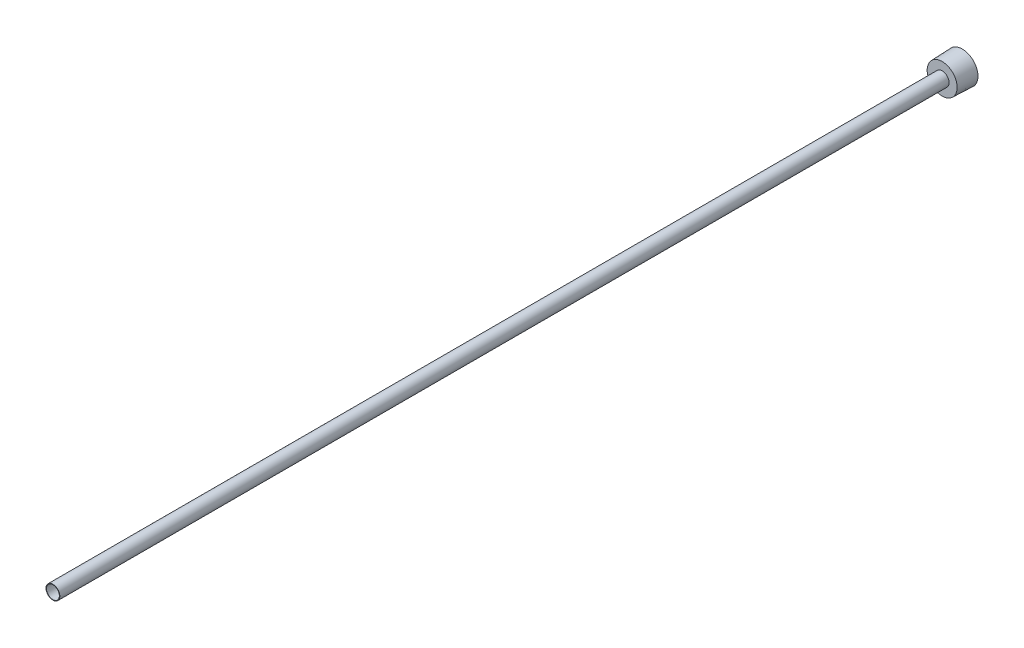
ISO-10303-21;
HEADER;
FILE_DESCRIPTION(('STEP AP214'),'2;1');
FILE_NAME('part.step','',(''),(''),'','','');
FILE_SCHEMA(('AUTOMOTIVE_DESIGN { 1 0 10303 214 1 1 1 1 }'));
ENDSEC;
DATA;
#1=APPLICATION_CONTEXT('core data for automotive mechanical design processes');
#2=APPLICATION_PROTOCOL_DEFINITION('international standard','automotive_design',2000,#1);
#3=PRODUCT_CONTEXT('',#1,'mechanical');
#4=PRODUCT('Part','Part','',(#3));
#5=PRODUCT_RELATED_PRODUCT_CATEGORY('part','',(#4));
#6=PRODUCT_DEFINITION_FORMATION('','',#4);
#7=PRODUCT_DEFINITION_CONTEXT('part definition',#1,'design');
#8=PRODUCT_DEFINITION('design','',#6,#7);
#9=PRODUCT_DEFINITION_SHAPE('','',#8);
#10=(LENGTH_UNIT() NAMED_UNIT(*) SI_UNIT(.MILLI.,.METRE.));
#11=(NAMED_UNIT(*) PLANE_ANGLE_UNIT() SI_UNIT($,.RADIAN.));
#12=(NAMED_UNIT(*) SI_UNIT($,.STERADIAN.) SOLID_ANGLE_UNIT());
#13=UNCERTAINTY_MEASURE_WITH_UNIT(LENGTH_MEASURE(1.E-05),#10,'distance_accuracy_value','');
#14=(GEOMETRIC_REPRESENTATION_CONTEXT(3) GLOBAL_UNCERTAINTY_ASSIGNED_CONTEXT((#13)) GLOBAL_UNIT_ASSIGNED_CONTEXT((#10,
#11,#12)) REPRESENTATION_CONTEXT('',''));
#15=CARTESIAN_POINT('',(0.,0.,0.));
#16=DIRECTION('',(0.,0.,1.));
#17=DIRECTION('',(1.,0.,0.));
#18=AXIS2_PLACEMENT_3D('',#15,#16,#17);
#19=CARTESIAN_POINT('',(0.,0.,0.));
#20=DIRECTION('',(0.,0.,1.));
#21=DIRECTION('',(1.,0.,0.));
#22=AXIS2_PLACEMENT_3D('',#19,#20,#21);
#23=CYLINDRICAL_SURFACE('',#22,4.318);
#24=CARTESIAN_POINT('',(0.,0.,609.6));
#25=DIRECTION('',(0.,0.,1.));
#26=DIRECTION('',(1.,0.,0.));
#27=AXIS2_PLACEMENT_3D('',#24,#25,#26);
#28=CIRCLE('',#27,4.318);
#29=CARTESIAN_POINT('',(4.318,0.,609.6));
#30=VERTEX_POINT('',#29);
#31=EDGE_CURVE('E142',#30,#30,#28,.T.);
#32=CARTESIAN_POINT('',(0.,0.,9.525));
#33=DIRECTION('',(0.,0.,-1.));
#34=DIRECTION('',(-1.,0.,0.));
#35=AXIS2_PLACEMENT_3D('',#32,#33,#34);
#36=CIRCLE('',#35,4.318);
#37=CARTESIAN_POINT('',(4.318,0.,9.525));
#38=VERTEX_POINT('',#37);
#39=EDGE_CURVE('E37',#38,#38,#36,.F.);
#40=CARTESIAN_POINT('',(4.318,0.,609.6));
#41=CARTESIAN_POINT('',(4.318,0.,603.34921875));
#42=CARTESIAN_POINT('',(4.318,0.,597.0984375));
#43=CARTESIAN_POINT('',(4.318,0.,584.596875));
#44=CARTESIAN_POINT('',(4.318,0.,578.34609375));
#45=CARTESIAN_POINT('',(4.318,0.,565.84453125));
#46=CARTESIAN_POINT('',(4.318,0.,559.59375));
#47=CARTESIAN_POINT('',(4.318,0.,547.0921875));
#48=CARTESIAN_POINT('',(4.318,0.,540.84140625));
#49=CARTESIAN_POINT('',(4.318,0.,528.33984375));
#50=CARTESIAN_POINT('',(4.318,0.,522.0890625));
#51=CARTESIAN_POINT('',(4.318,0.,509.5875));
#52=CARTESIAN_POINT('',(4.318,0.,503.33671875));
#53=CARTESIAN_POINT('',(4.318,0.,490.83515625));
#54=CARTESIAN_POINT('',(4.318,0.,484.584375));
#55=CARTESIAN_POINT('',(4.318,0.,472.0828125));
#56=CARTESIAN_POINT('',(4.318,0.,465.83203125));
#57=CARTESIAN_POINT('',(4.318,0.,453.33046875));
#58=CARTESIAN_POINT('',(4.318,0.,447.0796875));
#59=CARTESIAN_POINT('',(4.318,0.,434.578125));
#60=CARTESIAN_POINT('',(4.318,0.,428.32734375));
#61=CARTESIAN_POINT('',(4.318,0.,415.82578125));
#62=CARTESIAN_POINT('',(4.318,0.,409.575));
#63=CARTESIAN_POINT('',(4.318,0.,397.0734375));
#64=CARTESIAN_POINT('',(4.318,0.,390.82265625));
#65=CARTESIAN_POINT('',(4.318,0.,378.32109375));
#66=CARTESIAN_POINT('',(4.318,0.,372.0703125));
#67=CARTESIAN_POINT('',(4.318,0.,359.56875));
#68=CARTESIAN_POINT('',(4.318,0.,353.31796875));
#69=CARTESIAN_POINT('',(4.318,0.,340.81640625));
#70=CARTESIAN_POINT('',(4.318,0.,334.565625));
#71=CARTESIAN_POINT('',(4.318,0.,322.0640625));
#72=CARTESIAN_POINT('',(4.318,0.,315.81328125));
#73=CARTESIAN_POINT('',(4.318,0.,303.31171875));
#74=CARTESIAN_POINT('',(4.318,0.,297.0609375));
#75=CARTESIAN_POINT('',(4.318,0.,284.559375));
#76=CARTESIAN_POINT('',(4.318,0.,278.30859375));
#77=CARTESIAN_POINT('',(4.318,0.,265.80703125));
#78=CARTESIAN_POINT('',(4.318,0.,259.55625));
#79=CARTESIAN_POINT('',(4.318,0.,247.0546875));
#80=CARTESIAN_POINT('',(4.318,0.,240.80390625));
#81=CARTESIAN_POINT('',(4.318,0.,228.30234375));
#82=CARTESIAN_POINT('',(4.318,0.,222.0515625));
#83=CARTESIAN_POINT('',(4.318,0.,209.55));
#84=CARTESIAN_POINT('',(4.318,0.,203.29921875));
#85=CARTESIAN_POINT('',(4.318,0.,190.79765625));
#86=CARTESIAN_POINT('',(4.318,0.,184.546875));
#87=CARTESIAN_POINT('',(4.318,0.,172.0453125));
#88=CARTESIAN_POINT('',(4.318,0.,165.79453125));
#89=CARTESIAN_POINT('',(4.318,0.,153.29296875));
#90=CARTESIAN_POINT('',(4.318,0.,147.0421875));
#91=CARTESIAN_POINT('',(4.318,0.,134.540625));
#92=CARTESIAN_POINT('',(4.318,0.,128.28984375));
#93=CARTESIAN_POINT('',(4.318,0.,115.78828125));
#94=CARTESIAN_POINT('',(4.318,0.,109.5375));
#95=CARTESIAN_POINT('',(4.318,0.,97.0359375));
#96=CARTESIAN_POINT('',(4.318,0.,90.78515625));
#97=CARTESIAN_POINT('',(4.318,0.,78.28359375));
#98=CARTESIAN_POINT('',(4.318,0.,72.0328125));
#99=CARTESIAN_POINT('',(4.318,0.,59.53125));
#100=CARTESIAN_POINT('',(4.318,0.,53.28046875));
#101=CARTESIAN_POINT('',(4.318,0.,40.77890625));
#102=CARTESIAN_POINT('',(4.318,0.,34.528125));
#103=CARTESIAN_POINT('',(4.318,0.,22.0265625));
#104=CARTESIAN_POINT('',(4.318,0.,15.77578125));
#105=CARTESIAN_POINT('',(4.318,0.,9.525));
#106=B_SPLINE_CURVE_WITH_KNOTS('',3,(#40,#41,#42,#43,#44,#45,#46,#47,#48,#49,#50,#51,#52,#53,
#54,#55,#56,#57,#58,#59,#60,#61,#62,#63,#64,#65,#66,#67,#68,#69,#70,#71,#72,#73,#74,#75,#76,#77,
#78,#79,#80,#81,#82,#83,#84,#85,#86,#87,#88,#89,#90,#91,#92,#93,#94,#95,#96,#97,#98,#99,#100,
#101,#102,#103,#104,#105),.UNSPECIFIED.,.F.,.F.,(4,2,2,2,2,2,2,2,2,2,2,2,2,2,2,2,2,2,2,2,2,2,2,
2,2,2,2,2,2,2,2,2,4),(0.,18.75234375,37.5046875,56.25703125,75.009375,93.7617187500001,
112.5140625,131.26640625,150.01875,168.77109375,187.5234375,206.27578125,225.028125,
243.78046875,262.5328125,281.28515625,300.0375,318.78984375,337.5421875,356.29453125,375.046875,
393.79921875,412.5515625,431.30390625,450.05625,468.80859375,487.5609375,506.31328125,
525.065625,543.81796875,562.5703125,581.32265625,600.075),.UNSPECIFIED.);
#107=EDGE_CURVE('BSEAM33',#30,#38,#106,.T.);
#108=ORIENTED_EDGE('',*,*,#31,.T.);
#109=ORIENTED_EDGE('',*,*,#39,.F.);
#110=ORIENTED_EDGE('',*,*,#107,.T.);
#111=ORIENTED_EDGE('',*,*,#107,.F.);
#112=EDGE_LOOP('',(#108,#110,#109,#111));
#113=FACE_BOUND('',#112,.T.);
#114=ADVANCED_FACE('F33',(#113),#23,.F.);
#115=CARTESIAN_POINT('',(0.,0.,0.));
#116=DIRECTION('',(0.,0.,1.));
#117=DIRECTION('',(1.,0.,0.));
#118=AXIS2_PLACEMENT_3D('',#115,#116,#117);
#119=PLANE('',#118);
#120=DIRECTION('',(-0.866025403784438,0.5,0.));
#121=VECTOR('',#120,1.);
#122=CARTESIAN_POINT('',(0.,-7.33234841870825,0.));
#123=LINE('',#122,#121);
#124=CARTESIAN_POINT('',(0.,-7.33234841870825,0.));
#125=VERTEX_POINT('',#124);
#126=CARTESIAN_POINT('',(-6.35,-3.66617420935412,0.));
#127=VERTEX_POINT('',#126);
#128=EDGE_CURVE('E124',#125,#127,#123,.T.);
#129=ORIENTED_EDGE('',*,*,#128,.F.);
#130=DIRECTION('',(-0.866025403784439,-0.5,0.));
#131=VECTOR('',#130,1.);
#132=CARTESIAN_POINT('',(6.35,-3.66617420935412,0.));
#133=LINE('',#132,#131);
#134=CARTESIAN_POINT('',(6.35,-3.66617420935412,0.));
#135=VERTEX_POINT('',#134);
#136=EDGE_CURVE('E49',#135,#125,#133,.T.);
#137=ORIENTED_EDGE('',*,*,#136,.F.);
#138=DIRECTION('',(0.,-1.,0.));
#139=VECTOR('',#138,1.);
#140=CARTESIAN_POINT('',(6.35,3.66617420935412,0.));
#141=LINE('',#140,#139);
#142=CARTESIAN_POINT('',(6.35,3.66617420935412,0.));
#143=VERTEX_POINT('',#142);
#144=EDGE_CURVE('E133',#143,#135,#141,.T.);
#145=ORIENTED_EDGE('',*,*,#144,.F.);
#146=DIRECTION('',(0.866025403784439,-0.5,0.));
#147=VECTOR('',#146,1.);
#148=CARTESIAN_POINT('',(0.,7.33234841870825,0.));
#149=LINE('',#148,#147);
#150=CARTESIAN_POINT('',(0.,7.33234841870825,0.));
#151=VERTEX_POINT('',#150);
#152=EDGE_CURVE('E131',#151,#143,#149,.T.);
#153=ORIENTED_EDGE('',*,*,#152,.F.);
#154=DIRECTION('',(0.866025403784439,0.5,0.));
#155=VECTOR('',#154,1.);
#156=CARTESIAN_POINT('',(-6.35,3.66617420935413,0.));
#157=LINE('',#156,#155);
#158=CARTESIAN_POINT('',(-6.35,3.66617420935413,0.));
#159=VERTEX_POINT('',#158);
#160=EDGE_CURVE('E97',#159,#151,#157,.T.);
#161=ORIENTED_EDGE('',*,*,#160,.F.);
#162=DIRECTION('',(0.,1.,0.));
#163=VECTOR('',#162,1.);
#164=CARTESIAN_POINT('',(-6.35,-3.66617420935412,0.));
#165=LINE('',#164,#163);
#166=EDGE_CURVE('E127',#127,#159,#165,.T.);
#167=ORIENTED_EDGE('',*,*,#166,.F.);
#168=EDGE_LOOP('',(#129,#137,#145,#153,#161,#167));
#169=FACE_BOUND('',#168,.T.);
#170=CARTESIAN_POINT('',(0.,0.,0.));
#171=DIRECTION('',(0.,0.,1.));
#172=DIRECTION('',(1.,0.,0.));
#173=AXIS2_PLACEMENT_3D('',#170,#171,#172);
#174=CIRCLE('',#173,10.541);
#175=CARTESIAN_POINT('',(10.541,0.,0.));
#176=VERTEX_POINT('',#175);
#177=EDGE_CURVE('E11',#176,#176,#174,.T.);
#178=ORIENTED_EDGE('',*,*,#177,.F.);
#179=EDGE_LOOP('',(#178));
#180=FACE_BOUND('',#179,.T.);
#181=ADVANCED_FACE('F35',(#169,#180),#119,.F.);
#182=CARTESIAN_POINT('',(0.,0.,0.));
#183=DIRECTION('',(0.,0.,-1.));
#184=DIRECTION('',(-1.,0.,0.));
#185=AXIS2_PLACEMENT_3D('',#182,#183,#184);
#186=CONICAL_SURFACE('',#185,10.541,0.0364599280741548);
#187=CARTESIAN_POINT('',(0.,0.,13.4874));
#188=DIRECTION('',(0.,0.,1.));
#189=DIRECTION('',(1.,0.,0.));
#190=AXIS2_PLACEMENT_3D('',#187,#188,#189);
#191=CIRCLE('',#190,10.0490323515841);
#192=CARTESIAN_POINT('',(10.0490323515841,0.,13.4874));
#193=VERTEX_POINT('',#192);
#194=EDGE_CURVE('E42',#193,#193,#191,.T.);
#195=ORIENTED_EDGE('',*,*,#194,.F.);
#196=EDGE_LOOP('',(#195));
#197=FACE_BOUND('',#196,.T.);
#198=ORIENTED_EDGE('',*,*,#177,.T.);
#199=EDGE_LOOP('',(#198));
#200=FACE_BOUND('',#199,.T.);
#201=ADVANCED_FACE('F156',(#197,#200),#186,.T.);
#202=CARTESIAN_POINT('',(0.,10.0490323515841,13.4874));
#203=DIRECTION('',(0.,0.,-1.));
#204=DIRECTION('',(-1.,0.,0.));
#205=AXIS2_PLACEMENT_3D('',#202,#203,#204);
#206=PLANE('',#205);
#207=CARTESIAN_POINT('',(0.,0.,13.4874));
#208=DIRECTION('',(0.,0.,1.));
#209=DIRECTION('',(1.,0.,0.));
#210=AXIS2_PLACEMENT_3D('',#207,#208,#209);
#211=CIRCLE('',#210,4.6355);
#212=CARTESIAN_POINT('',(4.6355,0.,13.4874));
#213=VERTEX_POINT('',#212);
#214=EDGE_CURVE('E148',#213,#213,#211,.T.);
#215=ORIENTED_EDGE('',*,*,#214,.F.);
#216=EDGE_LOOP('',(#215));
#217=FACE_BOUND('',#216,.T.);
#218=ORIENTED_EDGE('',*,*,#194,.T.);
#219=EDGE_LOOP('',(#218));
#220=FACE_BOUND('',#219,.T.);
#221=ADVANCED_FACE('F154',(#217,#220),#206,.F.);
#222=CARTESIAN_POINT('',(0.,0.,223.212151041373));
#223=DIRECTION('',(0.,0.,1.));
#224=DIRECTION('',(1.,0.,0.));
#225=AXIS2_PLACEMENT_3D('',#222,#223,#224);
#226=CYLINDRICAL_SURFACE('',#225,4.63549999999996);
#227=CARTESIAN_POINT('',(0.,0.,609.6));
#228=DIRECTION('',(0.,0.,1.));
#229=DIRECTION('',(1.,0.,0.));
#230=AXIS2_PLACEMENT_3D('',#227,#228,#229);
#231=CIRCLE('',#230,4.63549999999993);
#232=CARTESIAN_POINT('',(4.63549999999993,0.,609.6));
#233=VERTEX_POINT('',#232);
#234=EDGE_CURVE('E145',#233,#233,#231,.T.);
#235=ORIENTED_EDGE('',*,*,#234,.F.);
#236=EDGE_LOOP('',(#235));
#237=FACE_BOUND('',#236,.T.);
#238=ORIENTED_EDGE('',*,*,#214,.T.);
#239=EDGE_LOOP('',(#238));
#240=FACE_BOUND('',#239,.T.);
#241=ADVANCED_FACE('F190',(#237,#240),#226,.T.);
#242=CARTESIAN_POINT('',(0.,4.63549999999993,609.6));
#243=DIRECTION('',(0.,0.,-1.));
#244=DIRECTION('',(-1.,0.,0.));
#245=AXIS2_PLACEMENT_3D('',#242,#243,#244);
#246=PLANE('',#245);
#247=ORIENTED_EDGE('',*,*,#31,.F.);
#248=EDGE_LOOP('',(#247));
#249=FACE_BOUND('',#248,.T.);
#250=ORIENTED_EDGE('',*,*,#234,.T.);
#251=EDGE_LOOP('',(#250));
#252=FACE_BOUND('',#251,.T.);
#253=ADVANCED_FACE('F183',(#249,#252),#246,.F.);
#254=CARTESIAN_POINT('',(0.,-7.33234841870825,9.525));
#255=DIRECTION('',(0.,0.,-1.));
#256=DIRECTION('',(-1.,0.,0.));
#257=AXIS2_PLACEMENT_3D('',#254,#255,#256);
#258=PLANE('',#257);
#259=DIRECTION('',(-0.866025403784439,-0.5,0.));
#260=VECTOR('',#259,1.);
#261=CARTESIAN_POINT('',(6.35,-3.66617420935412,9.525));
#262=LINE('',#261,#260);
#263=CARTESIAN_POINT('',(6.35,-3.66617420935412,9.525));
#264=VERTEX_POINT('',#263);
#265=CARTESIAN_POINT('',(0.,-7.33234841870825,9.525));
#266=VERTEX_POINT('',#265);
#267=EDGE_CURVE('E135',#264,#266,#262,.T.);
#268=ORIENTED_EDGE('',*,*,#267,.T.);
#269=DIRECTION('',(-0.866025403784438,0.5,0.));
#270=VECTOR('',#269,1.);
#271=CARTESIAN_POINT('',(0.,-7.33234841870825,9.525));
#272=LINE('',#271,#270);
#273=CARTESIAN_POINT('',(-6.35,-3.66617420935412,9.525));
#274=VERTEX_POINT('',#273);
#275=EDGE_CURVE('E118',#266,#274,#272,.T.);
#276=ORIENTED_EDGE('',*,*,#275,.T.);
#277=DIRECTION('',(0.,1.,0.));
#278=VECTOR('',#277,1.);
#279=CARTESIAN_POINT('',(-6.35,-3.66617420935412,9.525));
#280=LINE('',#279,#278);
#281=CARTESIAN_POINT('',(-6.35,3.66617420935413,9.525));
#282=VERTEX_POINT('',#281);
#283=EDGE_CURVE('E116',#274,#282,#280,.T.);
#284=ORIENTED_EDGE('',*,*,#283,.T.);
#285=DIRECTION('',(0.866025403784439,0.5,0.));
#286=VECTOR('',#285,1.);
#287=CARTESIAN_POINT('',(-6.35,3.66617420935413,9.525));
#288=LINE('',#287,#286);
#289=CARTESIAN_POINT('',(0.,7.33234841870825,9.525));
#290=VERTEX_POINT('',#289);
#291=EDGE_CURVE('E94',#282,#290,#288,.T.);
#292=ORIENTED_EDGE('',*,*,#291,.T.);
#293=DIRECTION('',(0.866025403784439,-0.5,0.));
#294=VECTOR('',#293,1.);
#295=CARTESIAN_POINT('',(0.,7.33234841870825,9.525));
#296=LINE('',#295,#294);
#297=CARTESIAN_POINT('',(6.35,3.66617420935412,9.525));
#298=VERTEX_POINT('',#297);
#299=EDGE_CURVE('E105',#290,#298,#296,.T.);
#300=ORIENTED_EDGE('',*,*,#299,.T.);
#301=DIRECTION('',(0.,-1.,0.));
#302=VECTOR('',#301,1.);
#303=CARTESIAN_POINT('',(6.35,3.66617420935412,9.525));
#304=LINE('',#303,#302);
#305=EDGE_CURVE('E109',#298,#264,#304,.T.);
#306=ORIENTED_EDGE('',*,*,#305,.T.);
#307=EDGE_LOOP('',(#268,#276,#284,#292,#300,#306));
#308=FACE_BOUND('',#307,.T.);
#309=ORIENTED_EDGE('',*,*,#39,.T.);
#310=EDGE_LOOP('',(#309));
#311=FACE_BOUND('',#310,.T.);
#312=ADVANCED_FACE('F112',(#308,#311),#258,.T.);
#313=CARTESIAN_POINT('',(6.35,-3.66617420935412,9.525));
#314=DIRECTION('',(0.5,-0.866025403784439,0.));
#315=DIRECTION('',(0.866025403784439,0.5,0.));
#316=AXIS2_PLACEMENT_3D('',#313,#314,#315);
#317=PLANE('',#316);
#318=ORIENTED_EDGE('',*,*,#136,.T.);
#319=DIRECTION('',(0.,0.,-1.));
#320=VECTOR('',#319,1.);
#321=CARTESIAN_POINT('',(0.,-7.33234841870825,9.525));
#322=LINE('',#321,#320);
#323=EDGE_CURVE('E79',#266,#125,#322,.T.);
#324=ORIENTED_EDGE('',*,*,#323,.F.);
#325=ORIENTED_EDGE('',*,*,#267,.F.);
#326=DIRECTION('',(0.,0.,-1.));
#327=VECTOR('',#326,1.);
#328=CARTESIAN_POINT('',(6.35,-3.66617420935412,9.525));
#329=LINE('',#328,#327);
#330=EDGE_CURVE('E57',#264,#135,#329,.T.);
#331=ORIENTED_EDGE('',*,*,#330,.T.);
#332=EDGE_LOOP('',(#318,#324,#325,#331));
#333=FACE_BOUND('',#332,.T.);
#334=ADVANCED_FACE('F174',(#333),#317,.F.);
#335=CARTESIAN_POINT('',(6.35,3.66617420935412,9.525));
#336=DIRECTION('',(1.,0.,0.));
#337=DIRECTION('',(0.,0.,-1.));
#338=AXIS2_PLACEMENT_3D('',#335,#336,#337);
#339=PLANE('',#338);
#340=ORIENTED_EDGE('',*,*,#144,.T.);
#341=ORIENTED_EDGE('',*,*,#330,.F.);
#342=ORIENTED_EDGE('',*,*,#305,.F.);
#343=DIRECTION('',(0.,0.,-1.));
#344=VECTOR('',#343,1.);
#345=CARTESIAN_POINT('',(6.35,3.66617420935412,9.525));
#346=LINE('',#345,#344);
#347=EDGE_CURVE('E101',#298,#143,#346,.T.);
#348=ORIENTED_EDGE('',*,*,#347,.T.);
#349=EDGE_LOOP('',(#340,#341,#342,#348));
#350=FACE_BOUND('',#349,.T.);
#351=ADVANCED_FACE('F176',(#350),#339,.F.);
#352=CARTESIAN_POINT('',(0.,7.33234841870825,9.525));
#353=DIRECTION('',(0.5,0.866025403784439,0.));
#354=DIRECTION('',(-0.866025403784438,0.5,0.));
#355=AXIS2_PLACEMENT_3D('',#352,#353,#354);
#356=PLANE('',#355);
#357=ORIENTED_EDGE('',*,*,#152,.T.);
#358=ORIENTED_EDGE('',*,*,#347,.F.);
#359=ORIENTED_EDGE('',*,*,#299,.F.);
#360=DIRECTION('',(0.,0.,-1.));
#361=VECTOR('',#360,1.);
#362=CARTESIAN_POINT('',(0.,7.33234841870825,9.525));
#363=LINE('',#362,#361);
#364=EDGE_CURVE('E90',#290,#151,#363,.T.);
#365=ORIENTED_EDGE('',*,*,#364,.T.);
#366=EDGE_LOOP('',(#357,#358,#359,#365));
#367=FACE_BOUND('',#366,.T.);
#368=ADVANCED_FACE('F106',(#367),#356,.F.);
#369=CARTESIAN_POINT('',(-6.35,3.66617420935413,9.525));
#370=DIRECTION('',(-0.5,0.866025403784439,0.));
#371=DIRECTION('',(-0.866025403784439,-0.5,0.));
#372=AXIS2_PLACEMENT_3D('',#369,#370,#371);
#373=PLANE('',#372);
#374=ORIENTED_EDGE('',*,*,#160,.T.);
#375=ORIENTED_EDGE('',*,*,#364,.F.);
#376=ORIENTED_EDGE('',*,*,#291,.F.);
#377=DIRECTION('',(0.,0.,-1.));
#378=VECTOR('',#377,1.);
#379=CARTESIAN_POINT('',(-6.35,3.66617420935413,9.525));
#380=LINE('',#379,#378);
#381=EDGE_CURVE('E102',#282,#159,#380,.T.);
#382=ORIENTED_EDGE('',*,*,#381,.T.);
#383=EDGE_LOOP('',(#374,#375,#376,#382));
#384=FACE_BOUND('',#383,.T.);
#385=ADVANCED_FACE('F92',(#384),#373,.F.);
#386=CARTESIAN_POINT('',(-6.35,-3.66617420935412,9.525));
#387=DIRECTION('',(-1.,0.,0.));
#388=DIRECTION('',(0.,-1.,0.));
#389=AXIS2_PLACEMENT_3D('',#386,#387,#388);
#390=PLANE('',#389);
#391=ORIENTED_EDGE('',*,*,#166,.T.);
#392=ORIENTED_EDGE('',*,*,#381,.F.);
#393=ORIENTED_EDGE('',*,*,#283,.F.);
#394=DIRECTION('',(0.,0.,-1.));
#395=VECTOR('',#394,1.);
#396=CARTESIAN_POINT('',(-6.35,-3.66617420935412,9.525));
#397=LINE('',#396,#395);
#398=EDGE_CURVE('E139',#274,#127,#397,.T.);
#399=ORIENTED_EDGE('',*,*,#398,.T.);
#400=EDGE_LOOP('',(#391,#392,#393,#399));
#401=FACE_BOUND('',#400,.T.);
#402=ADVANCED_FACE('F246',(#401),#390,.F.);
#403=CARTESIAN_POINT('',(0.,-7.33234841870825,9.525));
#404=DIRECTION('',(-0.5,-0.866025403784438,0.));
#405=DIRECTION('',(0.866025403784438,-0.5,0.));
#406=AXIS2_PLACEMENT_3D('',#403,#404,#405);
#407=PLANE('',#406);
#408=ORIENTED_EDGE('',*,*,#128,.T.);
#409=ORIENTED_EDGE('',*,*,#398,.F.);
#410=ORIENTED_EDGE('',*,*,#275,.F.);
#411=ORIENTED_EDGE('',*,*,#323,.T.);
#412=EDGE_LOOP('',(#408,#409,#410,#411));
#413=FACE_BOUND('',#412,.T.);
#414=ADVANCED_FACE('F172',(#413),#407,.F.);
#415=CLOSED_SHELL('',(#114,#181,#201,#221,#241,#253,#312,#334,#351,#368,#385,#402,#414));
#416=MANIFOLD_SOLID_BREP('B2',#415);
#417=ADVANCED_BREP_SHAPE_REPRESENTATION('',(#18,#416),#14);
#418=SHAPE_DEFINITION_REPRESENTATION(#9,#417);
ENDSEC;
END-ISO-10303-21;
